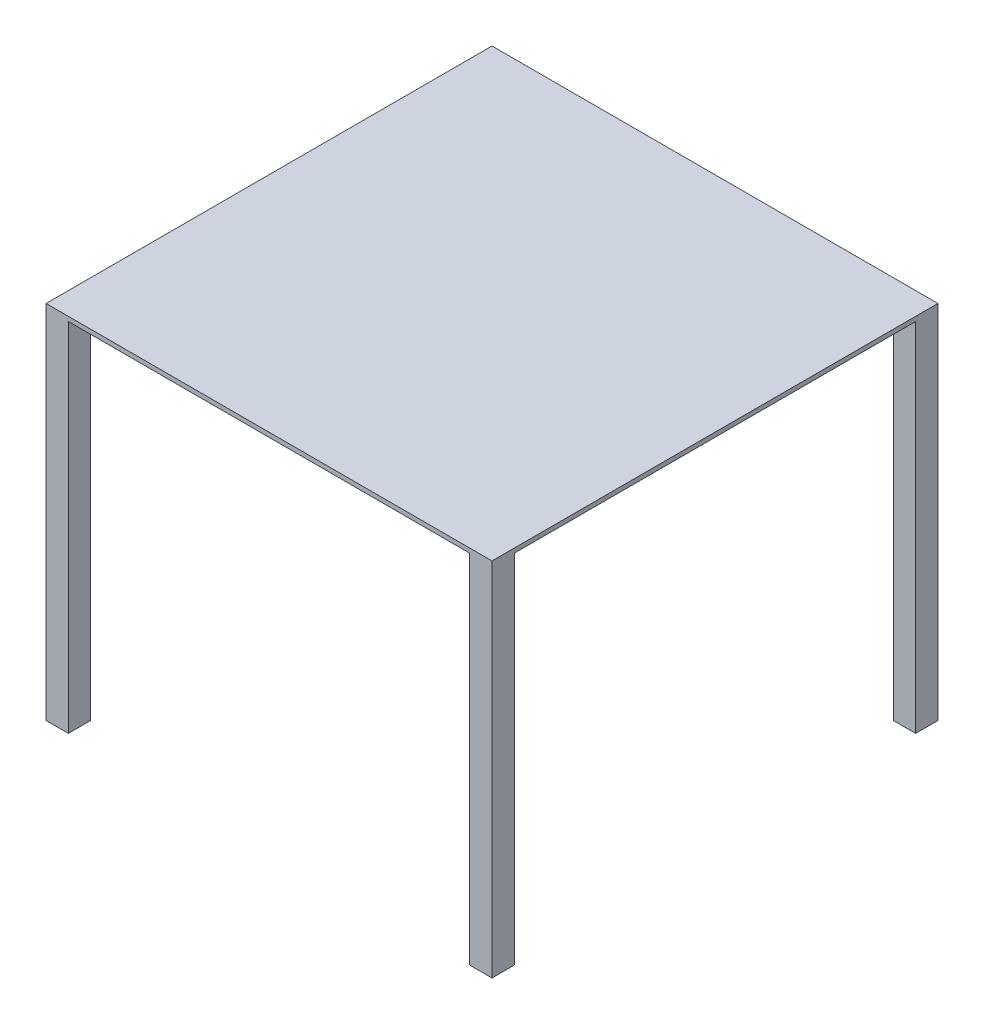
from build123d import *

# Parameters (mm, degrees)
ESQUISSE1_W          = 1000
ESQUISSE1_H          = 10
BASE_EXTRUSION_DEPTH = 1000
ESQUISSE2_W          = 50
ESQUISSE2_H          = 50
BOSS_EXTRU_1_DEPTH   = 800


with BuildPart() as part:
    # Esquisse1 → Base-Extrusion (new body)
    with BuildSketch(Plane.XY):
        with Locations((374.497154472, -6.409349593)):
            Rectangle(ESQUISSE1_W, ESQUISSE1_H)
    extrude(amount=BASE_EXTRUSION_DEPTH)

    # Esquisse2 → Boss.-Extru.1 (add)
    with BuildSketch(Plane.XZ.offset(11.409349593)):
        with Locations((849.497154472, 975)):
            Rectangle(ESQUISSE2_W, ESQUISSE2_H)
        with Locations((849.497154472, 25)):
            Rectangle(ESQUISSE2_W, ESQUISSE2_H)
        with Locations((-100.502845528, 25)):
            Rectangle(ESQUISSE2_W, ESQUISSE2_H)
        with Locations((-100.502845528, 975)):
            Rectangle(ESQUISSE2_W, ESQUISSE2_H)
    extrude(amount=BOSS_EXTRU_1_DEPTH)


solid = part.part
